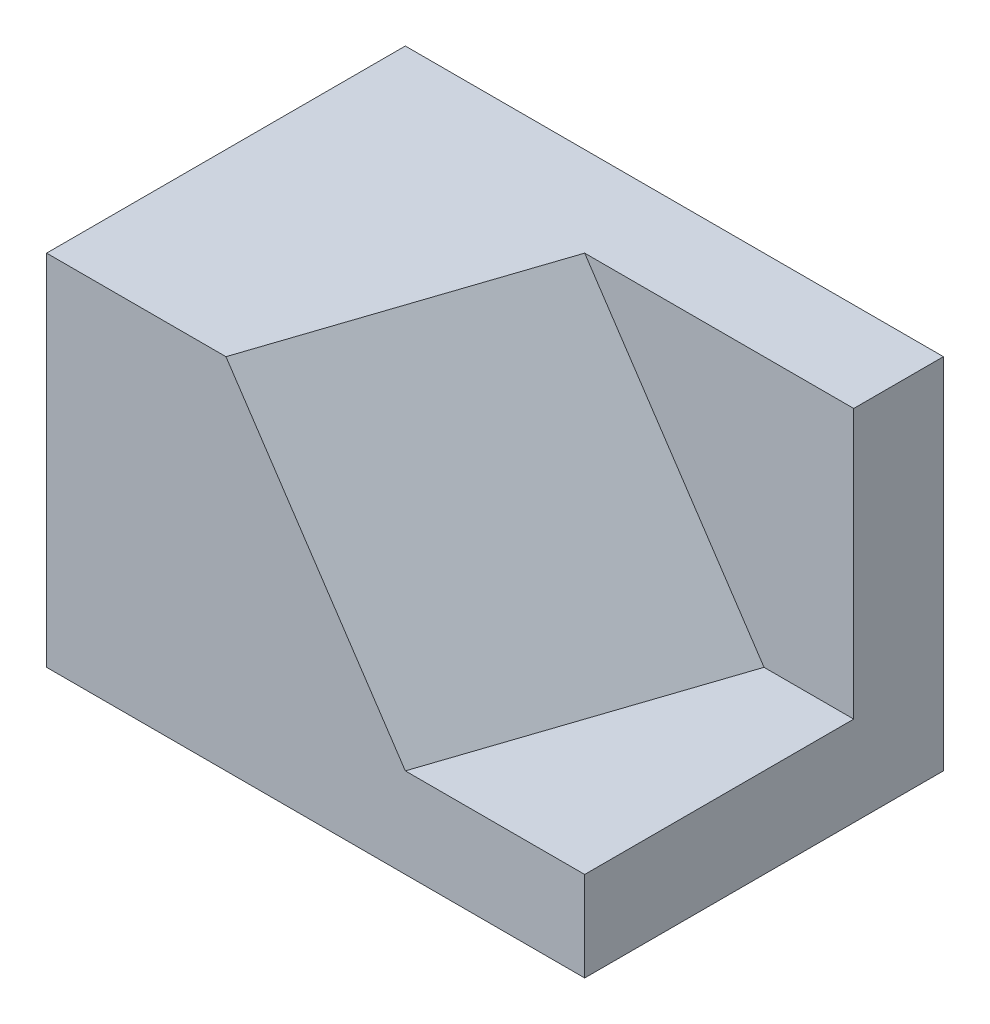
ISO-10303-21;
HEADER;
FILE_DESCRIPTION(('STEP AP214'),'2;1');
FILE_NAME('part.step','',(''),(''),'','','');
FILE_SCHEMA(('AUTOMOTIVE_DESIGN { 1 0 10303 214 1 1 1 1 }'));
ENDSEC;
DATA;
#1=APPLICATION_CONTEXT('core data for automotive mechanical design processes');
#2=APPLICATION_PROTOCOL_DEFINITION('international standard','automotive_design',2000,#1);
#3=PRODUCT_CONTEXT('',#1,'mechanical');
#4=PRODUCT('Part','Part','',(#3));
#5=PRODUCT_RELATED_PRODUCT_CATEGORY('part','',(#4));
#6=PRODUCT_DEFINITION_FORMATION('','',#4);
#7=PRODUCT_DEFINITION_CONTEXT('part definition',#1,'design');
#8=PRODUCT_DEFINITION('design','',#6,#7);
#9=PRODUCT_DEFINITION_SHAPE('','',#8);
#10=(LENGTH_UNIT() NAMED_UNIT(*) SI_UNIT(.MILLI.,.METRE.));
#11=(NAMED_UNIT(*) PLANE_ANGLE_UNIT() SI_UNIT($,.RADIAN.));
#12=(NAMED_UNIT(*) SI_UNIT($,.STERADIAN.) SOLID_ANGLE_UNIT());
#13=UNCERTAINTY_MEASURE_WITH_UNIT(LENGTH_MEASURE(1.E-05),#10,'distance_accuracy_value','');
#14=(GEOMETRIC_REPRESENTATION_CONTEXT(3) GLOBAL_UNCERTAINTY_ASSIGNED_CONTEXT((#13)) GLOBAL_UNIT_ASSIGNED_CONTEXT((#10,
#11,#12)) REPRESENTATION_CONTEXT('',''));
#15=CARTESIAN_POINT('',(0.,0.,0.));
#16=DIRECTION('',(0.,0.,1.));
#17=DIRECTION('',(1.,0.,0.));
#18=AXIS2_PLACEMENT_3D('',#15,#16,#17);
#19=CARTESIAN_POINT('',(0.,-10.,0.));
#20=DIRECTION('',(-1.,0.,0.));
#21=DIRECTION('',(0.,0.,1.));
#22=AXIS2_PLACEMENT_3D('',#19,#20,#21);
#23=PLANE('',#22);
#24=DIRECTION('',(0.,1.,0.));
#25=VECTOR('',#24,1.);
#26=CARTESIAN_POINT('',(0.,-10.,0.));
#27=LINE('',#26,#25);
#28=CARTESIAN_POINT('',(0.,-10.,0.));
#29=VERTEX_POINT('',#28);
#30=CARTESIAN_POINT('',(0.,30.,0.));
#31=VERTEX_POINT('',#30);
#32=EDGE_CURVE('E131',#29,#31,#27,.T.);
#33=ORIENTED_EDGE('',*,*,#32,.T.);
#34=DIRECTION('',(0.,0.,1.));
#35=VECTOR('',#34,1.);
#36=CARTESIAN_POINT('',(0.,30.,0.));
#37=LINE('',#36,#35);
#38=CARTESIAN_POINT('',(0.,30.,-40.));
#39=VERTEX_POINT('',#38);
#40=EDGE_CURVE('E109',#39,#31,#37,.T.);
#41=ORIENTED_EDGE('',*,*,#40,.F.);
#42=DIRECTION('',(0.,1.,0.));
#43=VECTOR('',#42,1.);
#44=CARTESIAN_POINT('',(0.,-10.,-40.));
#45=LINE('',#44,#43);
#46=CARTESIAN_POINT('',(0.,-10.,-40.));
#47=VERTEX_POINT('',#46);
#48=EDGE_CURVE('E12',#47,#39,#45,.T.);
#49=ORIENTED_EDGE('',*,*,#48,.F.);
#50=DIRECTION('',(0.,0.,1.));
#51=VECTOR('',#50,1.);
#52=CARTESIAN_POINT('',(0.,-10.,0.));
#53=LINE('',#52,#51);
#54=EDGE_CURVE('E139',#47,#29,#53,.T.);
#55=ORIENTED_EDGE('',*,*,#54,.T.);
#56=EDGE_LOOP('',(#33,#41,#49,#55));
#57=FACE_BOUND('',#56,.T.);
#58=ADVANCED_FACE('F38',(#57),#23,.T.);
#59=CARTESIAN_POINT('',(0.,-10.,-40.));
#60=DIRECTION('',(0.,0.,-1.));
#61=DIRECTION('',(-1.,0.,0.));
#62=AXIS2_PLACEMENT_3D('',#59,#60,#61);
#63=PLANE('',#62);
#64=ORIENTED_EDGE('',*,*,#48,.T.);
#65=DIRECTION('',(-1.,0.,0.));
#66=VECTOR('',#65,1.);
#67=CARTESIAN_POINT('',(0.,30.,-40.));
#68=LINE('',#67,#66);
#69=CARTESIAN_POINT('',(60.,30.,-40.));
#70=VERTEX_POINT('',#69);
#71=EDGE_CURVE('E126',#70,#39,#68,.T.);
#72=ORIENTED_EDGE('',*,*,#71,.F.);
#73=DIRECTION('',(0.,1.,0.));
#74=VECTOR('',#73,1.);
#75=CARTESIAN_POINT('',(60.,-10.,-40.));
#76=LINE('',#75,#74);
#77=CARTESIAN_POINT('',(60.,-10.,-40.));
#78=VERTEX_POINT('',#77);
#79=EDGE_CURVE('E47',#78,#70,#76,.T.);
#80=ORIENTED_EDGE('',*,*,#79,.F.);
#81=DIRECTION('',(-1.,0.,0.));
#82=VECTOR('',#81,1.);
#83=CARTESIAN_POINT('',(0.,-10.,-40.));
#84=LINE('',#83,#82);
#85=EDGE_CURVE('E147',#78,#47,#84,.T.);
#86=ORIENTED_EDGE('',*,*,#85,.T.);
#87=EDGE_LOOP('',(#64,#72,#80,#86));
#88=FACE_BOUND('',#87,.T.);
#89=ADVANCED_FACE('F209',(#88),#63,.T.);
#90=CARTESIAN_POINT('',(60.,-10.,0.));
#91=DIRECTION('',(1.,0.,0.));
#92=DIRECTION('',(0.,0.,-1.));
#93=AXIS2_PLACEMENT_3D('',#90,#91,#92);
#94=PLANE('',#93);
#95=DIRECTION('',(0.,0.,-1.));
#96=VECTOR('',#95,1.);
#97=CARTESIAN_POINT('',(60.,0.,-30.));
#98=LINE('',#97,#96);
#99=CARTESIAN_POINT('',(60.,0.,0.));
#100=VERTEX_POINT('',#99);
#101=CARTESIAN_POINT('',(60.,0.,-30.));
#102=VERTEX_POINT('',#101);
#103=EDGE_CURVE('E229',#100,#102,#98,.T.);
#104=ORIENTED_EDGE('',*,*,#103,.F.);
#105=DIRECTION('',(0.,1.,0.));
#106=VECTOR('',#105,1.);
#107=CARTESIAN_POINT('',(60.,-10.,0.));
#108=LINE('',#107,#106);
#109=CARTESIAN_POINT('',(60.,-10.,0.));
#110=VERTEX_POINT('',#109);
#111=EDGE_CURVE('E151',#110,#100,#108,.T.);
#112=ORIENTED_EDGE('',*,*,#111,.F.);
#113=DIRECTION('',(0.,0.,-1.));
#114=VECTOR('',#113,1.);
#115=CARTESIAN_POINT('',(60.,-10.,0.));
#116=LINE('',#115,#114);
#117=EDGE_CURVE('E144',#110,#78,#116,.T.);
#118=ORIENTED_EDGE('',*,*,#117,.T.);
#119=ORIENTED_EDGE('',*,*,#79,.T.);
#120=DIRECTION('',(0.,0.,-1.));
#121=VECTOR('',#120,1.);
#122=CARTESIAN_POINT('',(60.,30.,0.));
#123=LINE('',#122,#121);
#124=CARTESIAN_POINT('',(60.,30.,-30.));
#125=VERTEX_POINT('',#124);
#126=EDGE_CURVE('E124',#125,#70,#123,.T.);
#127=ORIENTED_EDGE('',*,*,#126,.F.);
#128=DIRECTION('',(0.,-1.,0.));
#129=VECTOR('',#128,1.);
#130=CARTESIAN_POINT('',(60.,30.,-30.));
#131=LINE('',#130,#129);
#132=EDGE_CURVE('E120',#125,#102,#131,.T.);
#133=ORIENTED_EDGE('',*,*,#132,.T.);
#134=EDGE_LOOP('',(#104,#112,#118,#119,#127,#133));
#135=FACE_BOUND('',#134,.T.);
#136=ADVANCED_FACE('F212',(#135),#94,.T.);
#137=CARTESIAN_POINT('',(0.,-10.,0.));
#138=DIRECTION('',(0.,0.,1.));
#139=DIRECTION('',(1.,0.,0.));
#140=AXIS2_PLACEMENT_3D('',#137,#138,#139);
#141=PLANE('',#140);
#142=DIRECTION('',(1.,0.,0.));
#143=VECTOR('',#142,1.);
#144=CARTESIAN_POINT('',(60.,0.,0.));
#145=LINE('',#144,#143);
#146=CARTESIAN_POINT('',(40.,0.,0.));
#147=VERTEX_POINT('',#146);
#148=EDGE_CURVE('E119',#147,#100,#145,.T.);
#149=ORIENTED_EDGE('',*,*,#148,.F.);
#150=DIRECTION('',(0.554700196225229,-0.832050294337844,0.));
#151=VECTOR('',#150,1.);
#152=CARTESIAN_POINT('',(20.,30.,0.));
#153=LINE('',#152,#151);
#154=CARTESIAN_POINT('',(20.,30.,0.));
#155=VERTEX_POINT('',#154);
#156=EDGE_CURVE('E103',#155,#147,#153,.T.);
#157=ORIENTED_EDGE('',*,*,#156,.F.);
#158=DIRECTION('',(1.,0.,0.));
#159=VECTOR('',#158,1.);
#160=CARTESIAN_POINT('',(0.,30.,0.));
#161=LINE('',#160,#159);
#162=EDGE_CURVE('E116',#31,#155,#161,.T.);
#163=ORIENTED_EDGE('',*,*,#162,.F.);
#164=ORIENTED_EDGE('',*,*,#32,.F.);
#165=DIRECTION('',(1.,0.,0.));
#166=VECTOR('',#165,1.);
#167=CARTESIAN_POINT('',(0.,-10.,0.));
#168=LINE('',#167,#166);
#169=EDGE_CURVE('E141',#29,#110,#168,.T.);
#170=ORIENTED_EDGE('',*,*,#169,.T.);
#171=ORIENTED_EDGE('',*,*,#111,.T.);
#172=EDGE_LOOP('',(#149,#157,#163,#164,#170,#171));
#173=FACE_BOUND('',#172,.T.);
#174=ADVANCED_FACE('F115',(#173),#141,.T.);
#175=CARTESIAN_POINT('',(0.,-10.,-40.));
#176=DIRECTION('',(0.,-1.,0.));
#177=DIRECTION('',(0.,0.,-1.));
#178=AXIS2_PLACEMENT_3D('',#175,#176,#177);
#179=PLANE('',#178);
#180=ORIENTED_EDGE('',*,*,#54,.F.);
#181=ORIENTED_EDGE('',*,*,#85,.F.);
#182=ORIENTED_EDGE('',*,*,#117,.F.);
#183=ORIENTED_EDGE('',*,*,#169,.F.);
#184=EDGE_LOOP('',(#180,#181,#182,#183));
#185=FACE_BOUND('',#184,.T.);
#186=ADVANCED_FACE('F205',(#185),#179,.T.);
#187=CARTESIAN_POINT('',(0.,30.,-40.));
#188=DIRECTION('',(0.,-1.,0.));
#189=DIRECTION('',(0.,0.,-1.));
#190=AXIS2_PLACEMENT_3D('',#187,#188,#189);
#191=PLANE('',#190);
#192=DIRECTION('',(-0.316227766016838,0.,0.948683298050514));
#193=VECTOR('',#192,1.);
#194=CARTESIAN_POINT('',(30.,30.,-30.));
#195=LINE('',#194,#193);
#196=CARTESIAN_POINT('',(30.,30.,-30.));
#197=VERTEX_POINT('',#196);
#198=EDGE_CURVE('E98',#197,#155,#195,.T.);
#199=ORIENTED_EDGE('',*,*,#198,.F.);
#200=DIRECTION('',(-1.,0.,0.));
#201=VECTOR('',#200,1.);
#202=CARTESIAN_POINT('',(60.,30.,-30.));
#203=LINE('',#202,#201);
#204=EDGE_CURVE('E55',#125,#197,#203,.T.);
#205=ORIENTED_EDGE('',*,*,#204,.F.);
#206=ORIENTED_EDGE('',*,*,#126,.T.);
#207=ORIENTED_EDGE('',*,*,#71,.T.);
#208=ORIENTED_EDGE('',*,*,#40,.T.);
#209=ORIENTED_EDGE('',*,*,#162,.T.);
#210=EDGE_LOOP('',(#199,#205,#206,#207,#208,#209));
#211=FACE_BOUND('',#210,.T.);
#212=ADVANCED_FACE('F122',(#211),#191,.F.);
#213=CARTESIAN_POINT('',(60.,0.,0.));
#214=DIRECTION('',(0.,-1.,0.));
#215=DIRECTION('',(0.,0.,-1.));
#216=AXIS2_PLACEMENT_3D('',#213,#214,#215);
#217=PLANE('',#216);
#218=ORIENTED_EDGE('',*,*,#103,.T.);
#219=DIRECTION('',(-1.,0.,0.));
#220=VECTOR('',#219,1.);
#221=CARTESIAN_POINT('',(50.,0.,-30.));
#222=LINE('',#221,#220);
#223=CARTESIAN_POINT('',(50.,0.,-30.));
#224=VERTEX_POINT('',#223);
#225=EDGE_CURVE('E41',#102,#224,#222,.T.);
#226=ORIENTED_EDGE('',*,*,#225,.T.);
#227=DIRECTION('',(-0.316227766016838,0.,0.948683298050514));
#228=VECTOR('',#227,1.);
#229=CARTESIAN_POINT('',(40.,0.,0.));
#230=LINE('',#229,#228);
#231=EDGE_CURVE('E163',#224,#147,#230,.T.);
#232=ORIENTED_EDGE('',*,*,#231,.T.);
#233=ORIENTED_EDGE('',*,*,#148,.T.);
#234=EDGE_LOOP('',(#218,#226,#232,#233));
#235=FACE_BOUND('',#234,.T.);
#236=ADVANCED_FACE('F183',(#235),#217,.F.);
#237=CARTESIAN_POINT('',(60.,0.,-30.));
#238=DIRECTION('',(0.,0.,-1.));
#239=DIRECTION('',(-1.,0.,0.));
#240=AXIS2_PLACEMENT_3D('',#237,#238,#239);
#241=PLANE('',#240);
#242=ORIENTED_EDGE('',*,*,#132,.F.);
#243=ORIENTED_EDGE('',*,*,#204,.T.);
#244=DIRECTION('',(0.554700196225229,-0.832050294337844,0.));
#245=VECTOR('',#244,1.);
#246=CARTESIAN_POINT('',(30.,30.,-30.));
#247=LINE('',#246,#245);
#248=EDGE_CURVE('E105',#197,#224,#247,.T.);
#249=ORIENTED_EDGE('',*,*,#248,.T.);
#250=ORIENTED_EDGE('',*,*,#225,.F.);
#251=EDGE_LOOP('',(#242,#243,#249,#250));
#252=FACE_BOUND('',#251,.T.);
#253=ADVANCED_FACE('F191',(#252),#241,.F.);
#254=CARTESIAN_POINT('',(50.,0.,-30.));
#255=DIRECTION('',(-0.801783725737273,-0.534522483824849,-0.267261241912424));
#256=DIRECTION('',(0.554700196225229,-0.832050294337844,0.));
#257=AXIS2_PLACEMENT_3D('',#254,#255,#256);
#258=PLANE('',#257);
#259=ORIENTED_EDGE('',*,*,#248,.F.);
#260=ORIENTED_EDGE('',*,*,#198,.T.);
#261=ORIENTED_EDGE('',*,*,#156,.T.);
#262=ORIENTED_EDGE('',*,*,#231,.F.);
#263=EDGE_LOOP('',(#259,#260,#261,#262));
#264=FACE_BOUND('',#263,.T.);
#265=ADVANCED_FACE('F101',(#264),#258,.F.);
#266=CLOSED_SHELL('',(#58,#89,#136,#174,#186,#212,#236,#253,#265));
#267=MANIFOLD_SOLID_BREP('B2',#266);
#268=ADVANCED_BREP_SHAPE_REPRESENTATION('',(#18,#267),#14);
#269=SHAPE_DEFINITION_REPRESENTATION(#9,#268);
ENDSEC;
END-ISO-10303-21;
